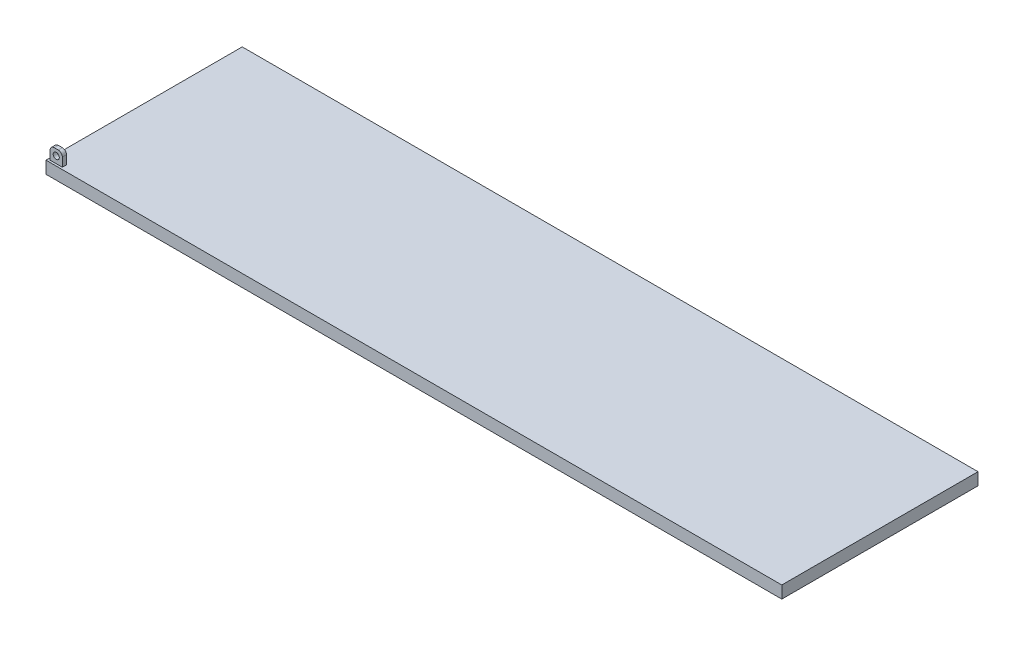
from build123d import *

# Parameters (mm, degrees)
SKETCH1_W           = 9144
SKETCH1_H           = 2438.4
BOSS_EXTRUDE1_DEPTH = 152.4
SKETCH2_W           = 152.4
SKETCH2_H           = 50.8
LIFTING_RING_DEPTH  = 159.866518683
FILLET1_R           = 50.8
CUT_EXTRUDE1_REACH  = 5181.118
SKETCH3_R           = 38.1


with BuildPart() as part:
    # Sketch1 → Boss-Extrude1 (new body)
    with BuildSketch(Plane(origin=(0, 0, 0), x_dir=(1, 0, 0), z_dir=(0, 1, 0))):
        Rectangle(SKETCH1_W, SKETCH1_H)
    extrude(amount=BOSS_EXTRUDE1_DEPTH)

    # Sketch2 → Lifting_ring (add)
    with BuildSketch(Plane(origin=(0, 152.4, 0), x_dir=(1, 0, 0), z_dir=(0, 1, 0))):
        with Locations((-4470.4, -1168.4)):
            Rectangle(SKETCH2_W, SKETCH2_H)
    extrude(amount=LIFTING_RING_DEPTH)

    # Fillet1
    fillet1_edges = [part.edges().sort_by_distance(p)[0] for p in [
        (-4394.2, 312.266518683, 1168.4),
        (-4546.6, 312.266518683, 1168.4),
    ]]
    fillet(fillet1_edges, radius=FILLET1_R)

    # Sketch3 → Cut-Extrude1 (cut, up to next)
    with BuildSketch(Plane.XY.offset(1193.8), mode=Mode.PRIVATE) as cut_extrude1_sk1:
        with Locations((-4470.4, 237.180741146)):
            Circle(SKETCH3_R)
    cut_extrude1_tool1 = extrude(cut_extrude1_sk1.sketch, amount=-CUT_EXTRUDE1_REACH, mode=Mode.PRIVATE) & part.part
    add(cut_extrude1_tool1.solids().sort_by_distance((-4470.4, 237.180741, 1193.8))[0], mode=Mode.SUBTRACT)


solid = part.part
